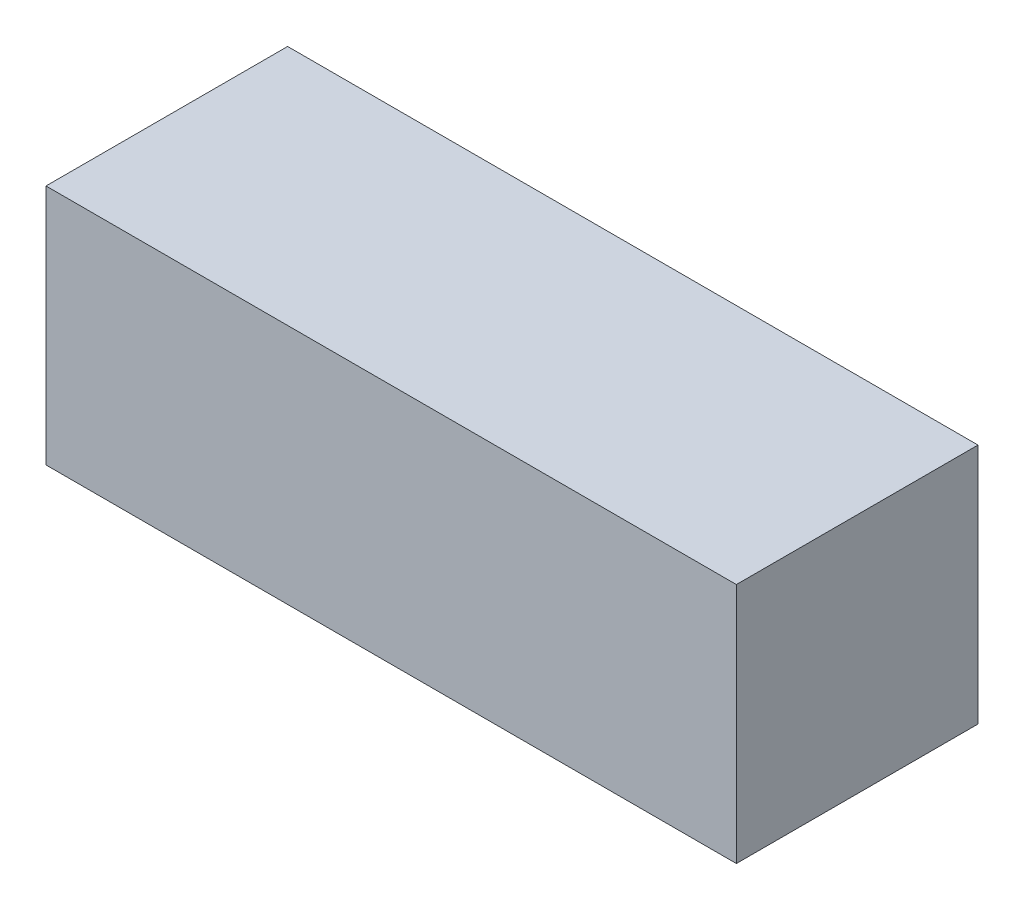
ISO-10303-21;
HEADER;
FILE_DESCRIPTION(('STEP AP214'),'2;1');
FILE_NAME('part.step','',(''),(''),'','','');
FILE_SCHEMA(('AUTOMOTIVE_DESIGN { 1 0 10303 214 1 1 1 1 }'));
ENDSEC;
DATA;
#1=APPLICATION_CONTEXT('core data for automotive mechanical design processes');
#2=APPLICATION_PROTOCOL_DEFINITION('international standard','automotive_design',2000,#1);
#3=PRODUCT_CONTEXT('',#1,'mechanical');
#4=PRODUCT('Part','Part','',(#3));
#5=PRODUCT_RELATED_PRODUCT_CATEGORY('part','',(#4));
#6=PRODUCT_DEFINITION_FORMATION('','',#4);
#7=PRODUCT_DEFINITION_CONTEXT('part definition',#1,'design');
#8=PRODUCT_DEFINITION('design','',#6,#7);
#9=PRODUCT_DEFINITION_SHAPE('','',#8);
#10=(LENGTH_UNIT() NAMED_UNIT(*) SI_UNIT(.MILLI.,.METRE.));
#11=(NAMED_UNIT(*) PLANE_ANGLE_UNIT() SI_UNIT($,.RADIAN.));
#12=(NAMED_UNIT(*) SI_UNIT($,.STERADIAN.) SOLID_ANGLE_UNIT());
#13=UNCERTAINTY_MEASURE_WITH_UNIT(LENGTH_MEASURE(1.E-05),#10,'distance_accuracy_value','');
#14=(GEOMETRIC_REPRESENTATION_CONTEXT(3) GLOBAL_UNCERTAINTY_ASSIGNED_CONTEXT((#13)) GLOBAL_UNIT_ASSIGNED_CONTEXT((#10,
#11,#12)) REPRESENTATION_CONTEXT('',''));
#15=CARTESIAN_POINT('',(0.,0.,0.));
#16=DIRECTION('',(0.,0.,1.));
#17=DIRECTION('',(1.,0.,0.));
#18=AXIS2_PLACEMENT_3D('',#15,#16,#17);
#19=CARTESIAN_POINT('',(0.,70.,0.));
#20=DIRECTION('',(1.,0.,0.));
#21=DIRECTION('',(0.,0.,-1.));
#22=AXIS2_PLACEMENT_3D('',#19,#20,#21);
#23=PLANE('',#22);
#24=DIRECTION('',(0.,0.,1.));
#25=VECTOR('',#24,1.);
#26=CARTESIAN_POINT('',(0.,0.,0.));
#27=LINE('',#26,#25);
#28=CARTESIAN_POINT('',(0.,0.,-70.));
#29=VERTEX_POINT('',#28);
#30=CARTESIAN_POINT('',(0.,0.,0.));
#31=VERTEX_POINT('',#30);
#32=EDGE_CURVE('E107',#29,#31,#27,.T.);
#33=ORIENTED_EDGE('',*,*,#32,.T.);
#34=DIRECTION('',(0.,-1.,0.));
#35=VECTOR('',#34,1.);
#36=CARTESIAN_POINT('',(0.,70.,0.));
#37=LINE('',#36,#35);
#38=CARTESIAN_POINT('',(0.,70.,0.));
#39=VERTEX_POINT('',#38);
#40=EDGE_CURVE('E11',#39,#31,#37,.T.);
#41=ORIENTED_EDGE('',*,*,#40,.F.);
#42=DIRECTION('',(0.,0.,1.));
#43=VECTOR('',#42,1.);
#44=CARTESIAN_POINT('',(0.,70.,0.));
#45=LINE('',#44,#43);
#46=CARTESIAN_POINT('',(0.,70.,-70.));
#47=VERTEX_POINT('',#46);
#48=EDGE_CURVE('E91',#47,#39,#45,.T.);
#49=ORIENTED_EDGE('',*,*,#48,.F.);
#50=DIRECTION('',(0.,-1.,0.));
#51=VECTOR('',#50,1.);
#52=CARTESIAN_POINT('',(0.,70.,-70.));
#53=LINE('',#52,#51);
#54=EDGE_CURVE('E103',#47,#29,#53,.T.);
#55=ORIENTED_EDGE('',*,*,#54,.T.);
#56=EDGE_LOOP('',(#33,#41,#49,#55));
#57=FACE_BOUND('',#56,.T.);
#58=ADVANCED_FACE('F39',(#57),#23,.F.);
#59=CARTESIAN_POINT('',(0.,70.,0.));
#60=DIRECTION('',(0.,0.,-1.));
#61=DIRECTION('',(-1.,0.,0.));
#62=AXIS2_PLACEMENT_3D('',#59,#60,#61);
#63=PLANE('',#62);
#64=DIRECTION('',(1.,0.,0.));
#65=VECTOR('',#64,1.);
#66=CARTESIAN_POINT('',(0.,0.,0.));
#67=LINE('',#66,#65);
#68=CARTESIAN_POINT('',(200.,0.,0.));
#69=VERTEX_POINT('',#68);
#70=EDGE_CURVE('E96',#31,#69,#67,.T.);
#71=ORIENTED_EDGE('',*,*,#70,.T.);
#72=DIRECTION('',(0.,-1.,0.));
#73=VECTOR('',#72,1.);
#74=CARTESIAN_POINT('',(200.,70.,0.));
#75=LINE('',#74,#73);
#76=CARTESIAN_POINT('',(200.,70.,0.));
#77=VERTEX_POINT('',#76);
#78=EDGE_CURVE('E48',#77,#69,#75,.T.);
#79=ORIENTED_EDGE('',*,*,#78,.F.);
#80=DIRECTION('',(1.,0.,0.));
#81=VECTOR('',#80,1.);
#82=CARTESIAN_POINT('',(0.,70.,0.));
#83=LINE('',#82,#81);
#84=EDGE_CURVE('E86',#39,#77,#83,.T.);
#85=ORIENTED_EDGE('',*,*,#84,.F.);
#86=ORIENTED_EDGE('',*,*,#40,.T.);
#87=EDGE_LOOP('',(#71,#79,#85,#86));
#88=FACE_BOUND('',#87,.T.);
#89=ADVANCED_FACE('F95',(#88),#63,.F.);
#90=CARTESIAN_POINT('',(200.,70.,0.));
#91=DIRECTION('',(-1.,0.,0.));
#92=DIRECTION('',(0.,0.,1.));
#93=AXIS2_PLACEMENT_3D('',#90,#91,#92);
#94=PLANE('',#93);
#95=DIRECTION('',(0.,0.,-1.));
#96=VECTOR('',#95,1.);
#97=CARTESIAN_POINT('',(200.,0.,0.));
#98=LINE('',#97,#96);
#99=CARTESIAN_POINT('',(200.,0.,-70.));
#100=VERTEX_POINT('',#99);
#101=EDGE_CURVE('E73',#69,#100,#98,.T.);
#102=ORIENTED_EDGE('',*,*,#101,.T.);
#103=DIRECTION('',(0.,-1.,0.));
#104=VECTOR('',#103,1.);
#105=CARTESIAN_POINT('',(200.,70.,-70.));
#106=LINE('',#105,#104);
#107=CARTESIAN_POINT('',(200.,70.,-70.));
#108=VERTEX_POINT('',#107);
#109=EDGE_CURVE('E98',#108,#100,#106,.T.);
#110=ORIENTED_EDGE('',*,*,#109,.F.);
#111=DIRECTION('',(0.,0.,-1.));
#112=VECTOR('',#111,1.);
#113=CARTESIAN_POINT('',(200.,70.,0.));
#114=LINE('',#113,#112);
#115=EDGE_CURVE('E89',#77,#108,#114,.T.);
#116=ORIENTED_EDGE('',*,*,#115,.F.);
#117=ORIENTED_EDGE('',*,*,#78,.T.);
#118=EDGE_LOOP('',(#102,#110,#116,#117));
#119=FACE_BOUND('',#118,.T.);
#120=ADVANCED_FACE('F99',(#119),#94,.F.);
#121=CARTESIAN_POINT('',(0.,70.,-70.));
#122=DIRECTION('',(0.,0.,1.));
#123=DIRECTION('',(1.,0.,0.));
#124=AXIS2_PLACEMENT_3D('',#121,#122,#123);
#125=PLANE('',#124);
#126=DIRECTION('',(-1.,0.,0.));
#127=VECTOR('',#126,1.);
#128=CARTESIAN_POINT('',(0.,0.,-70.));
#129=LINE('',#128,#127);
#130=EDGE_CURVE('E79',#100,#29,#129,.T.);
#131=ORIENTED_EDGE('',*,*,#130,.T.);
#132=ORIENTED_EDGE('',*,*,#54,.F.);
#133=DIRECTION('',(-1.,0.,0.));
#134=VECTOR('',#133,1.);
#135=CARTESIAN_POINT('',(0.,70.,-70.));
#136=LINE('',#135,#134);
#137=EDGE_CURVE('E56',#108,#47,#136,.T.);
#138=ORIENTED_EDGE('',*,*,#137,.F.);
#139=ORIENTED_EDGE('',*,*,#109,.T.);
#140=EDGE_LOOP('',(#131,#132,#138,#139));
#141=FACE_BOUND('',#140,.T.);
#142=ADVANCED_FACE('F120',(#141),#125,.F.);
#143=CARTESIAN_POINT('',(0.,70.,0.));
#144=DIRECTION('',(0.,-1.,0.));
#145=DIRECTION('',(0.,0.,-1.));
#146=AXIS2_PLACEMENT_3D('',#143,#144,#145);
#147=PLANE('',#146);
#148=ORIENTED_EDGE('',*,*,#48,.T.);
#149=ORIENTED_EDGE('',*,*,#84,.T.);
#150=ORIENTED_EDGE('',*,*,#115,.T.);
#151=ORIENTED_EDGE('',*,*,#137,.T.);
#152=EDGE_LOOP('',(#148,#149,#150,#151));
#153=FACE_BOUND('',#152,.T.);
#154=ADVANCED_FACE('F87',(#153),#147,.F.);
#155=CARTESIAN_POINT('',(0.,0.,0.));
#156=DIRECTION('',(0.,-1.,0.));
#157=DIRECTION('',(0.,0.,-1.));
#158=AXIS2_PLACEMENT_3D('',#155,#156,#157);
#159=PLANE('',#158);
#160=ORIENTED_EDGE('',*,*,#32,.F.);
#161=ORIENTED_EDGE('',*,*,#130,.F.);
#162=ORIENTED_EDGE('',*,*,#101,.F.);
#163=ORIENTED_EDGE('',*,*,#70,.F.);
#164=EDGE_LOOP('',(#160,#161,#162,#163));
#165=FACE_BOUND('',#164,.T.);
#166=ADVANCED_FACE('F123',(#165),#159,.T.);
#167=CLOSED_SHELL('',(#58,#89,#120,#142,#154,#166));
#168=MANIFOLD_SOLID_BREP('B2',#167);
#169=ADVANCED_BREP_SHAPE_REPRESENTATION('',(#18,#168),#14);
#170=SHAPE_DEFINITION_REPRESENTATION(#9,#169);
ENDSEC;
END-ISO-10303-21;
